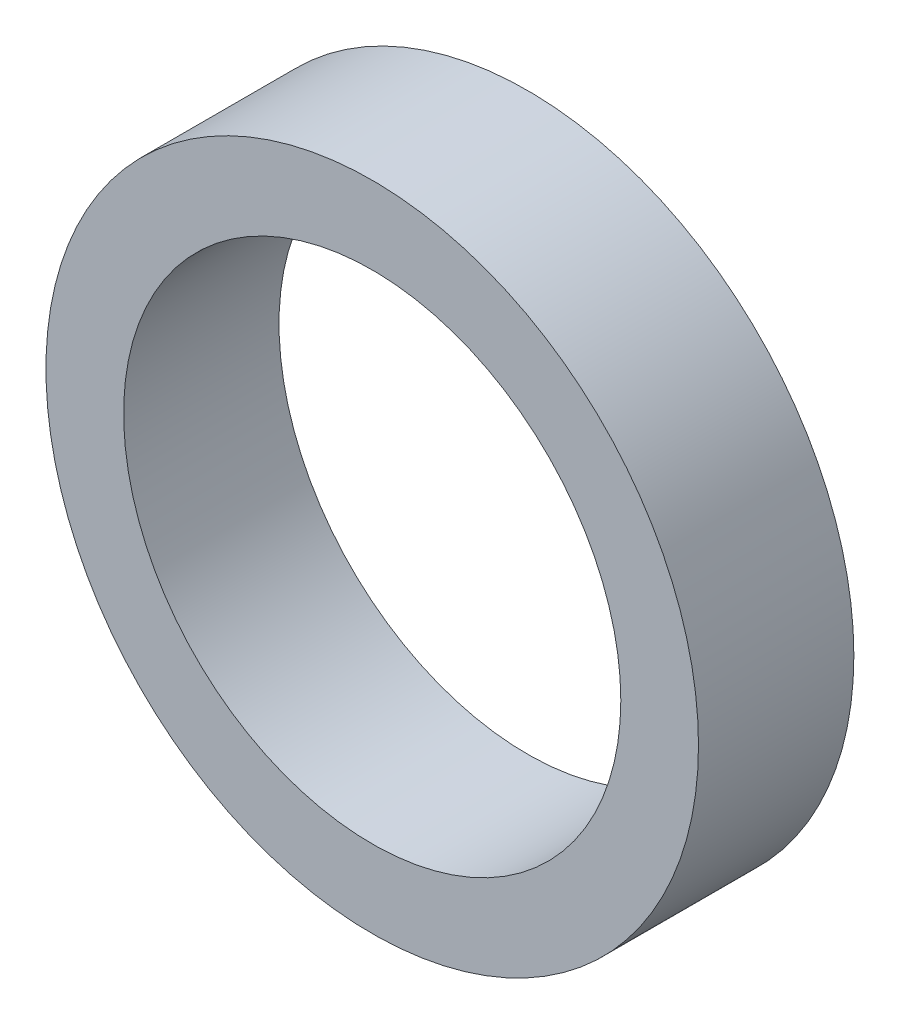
ISO-10303-21;
HEADER;
FILE_DESCRIPTION(('STEP AP214'),'2;1');
FILE_NAME('part.step','',(''),(''),'','','');
FILE_SCHEMA(('AUTOMOTIVE_DESIGN { 1 0 10303 214 1 1 1 1 }'));
ENDSEC;
DATA;
#1=APPLICATION_CONTEXT('core data for automotive mechanical design processes');
#2=APPLICATION_PROTOCOL_DEFINITION('international standard','automotive_design',2000,#1);
#3=PRODUCT_CONTEXT('',#1,'mechanical');
#4=PRODUCT('Part','Part','',(#3));
#5=PRODUCT_RELATED_PRODUCT_CATEGORY('part','',(#4));
#6=PRODUCT_DEFINITION_FORMATION('','',#4);
#7=PRODUCT_DEFINITION_CONTEXT('part definition',#1,'design');
#8=PRODUCT_DEFINITION('design','',#6,#7);
#9=PRODUCT_DEFINITION_SHAPE('','',#8);
#10=(LENGTH_UNIT() NAMED_UNIT(*) SI_UNIT(.MILLI.,.METRE.));
#11=(NAMED_UNIT(*) PLANE_ANGLE_UNIT() SI_UNIT($,.RADIAN.));
#12=(NAMED_UNIT(*) SI_UNIT($,.STERADIAN.) SOLID_ANGLE_UNIT());
#13=UNCERTAINTY_MEASURE_WITH_UNIT(LENGTH_MEASURE(1.E-05),#10,'distance_accuracy_value','');
#14=(GEOMETRIC_REPRESENTATION_CONTEXT(3) GLOBAL_UNCERTAINTY_ASSIGNED_CONTEXT((#13)) GLOBAL_UNIT_ASSIGNED_CONTEXT((#10,
#11,#12)) REPRESENTATION_CONTEXT('',''));
#15=CARTESIAN_POINT('',(0.,0.,0.));
#16=DIRECTION('',(0.,0.,1.));
#17=DIRECTION('',(1.,0.,0.));
#18=AXIS2_PLACEMENT_3D('',#15,#16,#17);
#19=CARTESIAN_POINT('',(0.,0.,5.));
#20=DIRECTION('',(0.,0.,-1.));
#21=DIRECTION('',(0.,1.,0.));
#22=AXIS2_PLACEMENT_3D('',#19,#20,#21);
#23=CYLINDRICAL_SURFACE('',#22,8.);
#24=CARTESIAN_POINT('',(0.,0.,5.));
#25=DIRECTION('',(0.,0.,-1.));
#26=DIRECTION('',(1.,0.,0.));
#27=AXIS2_PLACEMENT_3D('',#24,#25,#26);
#28=CIRCLE('',#27,8.);
#29=CARTESIAN_POINT('',(8.,0.,5.));
#30=VERTEX_POINT('',#29);
#31=EDGE_CURVE('E8',#30,#30,#28,.T.);
#32=ORIENTED_EDGE('',*,*,#31,.F.);
#33=EDGE_LOOP('',(#32));
#34=FACE_BOUND('',#33,.T.);
#35=CARTESIAN_POINT('',(0.,0.,0.));
#36=DIRECTION('',(0.,0.,-1.));
#37=DIRECTION('',(1.,0.,0.));
#38=AXIS2_PLACEMENT_3D('',#35,#36,#37);
#39=CIRCLE('',#38,8.);
#40=CARTESIAN_POINT('',(8.,0.,0.));
#41=VERTEX_POINT('',#40);
#42=EDGE_CURVE('E23',#41,#41,#39,.T.);
#43=ORIENTED_EDGE('',*,*,#42,.T.);
#44=EDGE_LOOP('',(#43));
#45=FACE_BOUND('',#44,.T.);
#46=ADVANCED_FACE('F12',(#34,#45),#23,.F.);
#47=CARTESIAN_POINT('',(0.,0.,5.));
#48=DIRECTION('',(0.,0.,-1.));
#49=DIRECTION('',(0.,1.,0.));
#50=AXIS2_PLACEMENT_3D('',#47,#48,#49);
#51=CYLINDRICAL_SURFACE('',#50,10.5);
#52=CARTESIAN_POINT('',(0.,0.,5.));
#53=DIRECTION('',(0.,0.,-1.));
#54=DIRECTION('',(1.,0.,0.));
#55=AXIS2_PLACEMENT_3D('',#52,#53,#54);
#56=CIRCLE('',#55,10.5);
#57=CARTESIAN_POINT('',(10.5,0.,5.));
#58=VERTEX_POINT('',#57);
#59=EDGE_CURVE('E19',#58,#58,#56,.T.);
#60=ORIENTED_EDGE('',*,*,#59,.T.);
#61=EDGE_LOOP('',(#60));
#62=FACE_BOUND('',#61,.T.);
#63=CARTESIAN_POINT('',(0.,0.,0.));
#64=DIRECTION('',(0.,0.,-1.));
#65=DIRECTION('',(1.,0.,0.));
#66=AXIS2_PLACEMENT_3D('',#63,#64,#65);
#67=CIRCLE('',#66,10.5);
#68=CARTESIAN_POINT('',(10.5,0.,0.));
#69=VERTEX_POINT('',#68);
#70=EDGE_CURVE('E28',#69,#69,#67,.T.);
#71=ORIENTED_EDGE('',*,*,#70,.F.);
#72=EDGE_LOOP('',(#71));
#73=FACE_BOUND('',#72,.T.);
#74=ADVANCED_FACE('F14',(#62,#73),#51,.T.);
#75=CARTESIAN_POINT('',(0.,0.,5.));
#76=DIRECTION('',(0.,0.,-1.));
#77=DIRECTION('',(0.,1.,0.));
#78=AXIS2_PLACEMENT_3D('',#75,#76,#77);
#79=PLANE('',#78);
#80=ORIENTED_EDGE('',*,*,#31,.T.);
#81=EDGE_LOOP('',(#80));
#82=FACE_BOUND('',#81,.T.);
#83=ORIENTED_EDGE('',*,*,#59,.F.);
#84=EDGE_LOOP('',(#83));
#85=FACE_BOUND('',#84,.T.);
#86=ADVANCED_FACE('F40',(#82,#85),#79,.F.);
#87=CARTESIAN_POINT('',(0.,0.,0.));
#88=DIRECTION('',(0.,0.,-1.));
#89=DIRECTION('',(0.,1.,0.));
#90=AXIS2_PLACEMENT_3D('',#87,#88,#89);
#91=PLANE('',#90);
#92=ORIENTED_EDGE('',*,*,#42,.F.);
#93=EDGE_LOOP('',(#92));
#94=FACE_BOUND('',#93,.T.);
#95=ORIENTED_EDGE('',*,*,#70,.T.);
#96=EDGE_LOOP('',(#95));
#97=FACE_BOUND('',#96,.T.);
#98=ADVANCED_FACE('F37',(#94,#97),#91,.T.);
#99=CLOSED_SHELL('',(#46,#74,#86,#98));
#100=MANIFOLD_SOLID_BREP('B1',#99);
#101=ADVANCED_BREP_SHAPE_REPRESENTATION('',(#18,#100),#14);
#102=SHAPE_DEFINITION_REPRESENTATION(#9,#101);
ENDSEC;
END-ISO-10303-21;
